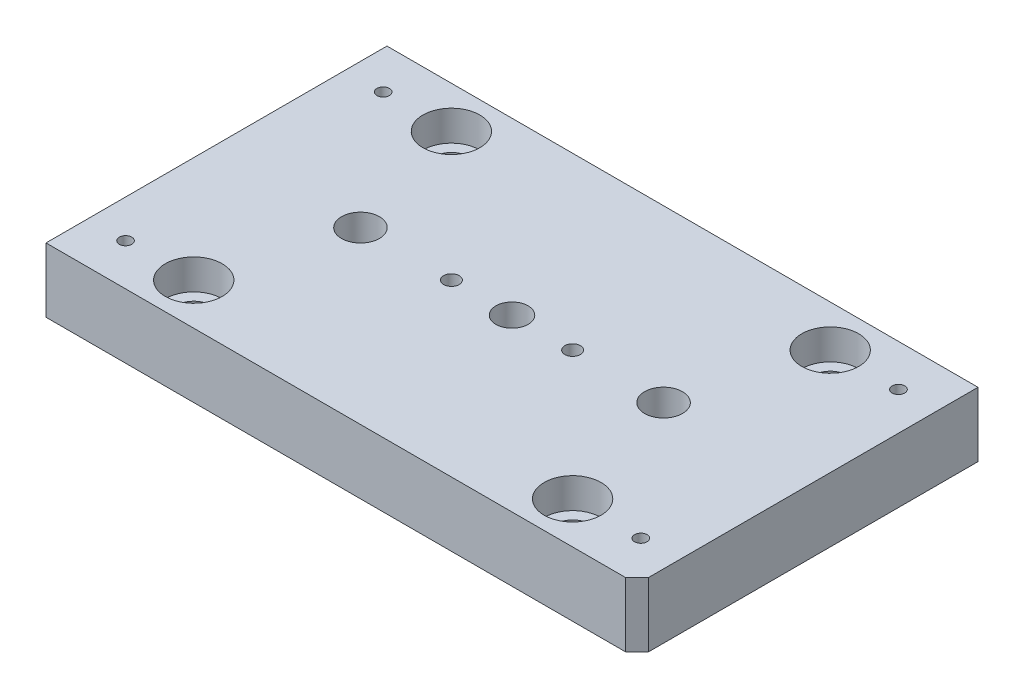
ISO-10303-21;
HEADER;
FILE_DESCRIPTION(('STEP AP214'),'2;1');
FILE_NAME('part.step','',(''),(''),'','','');
FILE_SCHEMA(('AUTOMOTIVE_DESIGN { 1 0 10303 214 1 1 1 1 }'));
ENDSEC;
DATA;
#1=APPLICATION_CONTEXT('core data for automotive mechanical design processes');
#2=APPLICATION_PROTOCOL_DEFINITION('international standard','automotive_design',2000,#1);
#3=PRODUCT_CONTEXT('',#1,'mechanical');
#4=PRODUCT('Part','Part','',(#3));
#5=PRODUCT_RELATED_PRODUCT_CATEGORY('part','',(#4));
#6=PRODUCT_DEFINITION_FORMATION('','',#4);
#7=PRODUCT_DEFINITION_CONTEXT('part definition',#1,'design');
#8=PRODUCT_DEFINITION('design','',#6,#7);
#9=PRODUCT_DEFINITION_SHAPE('','',#8);
#10=(LENGTH_UNIT() NAMED_UNIT(*) SI_UNIT(.MILLI.,.METRE.));
#11=(NAMED_UNIT(*) PLANE_ANGLE_UNIT() SI_UNIT($,.RADIAN.));
#12=(NAMED_UNIT(*) SI_UNIT($,.STERADIAN.) SOLID_ANGLE_UNIT());
#13=UNCERTAINTY_MEASURE_WITH_UNIT(LENGTH_MEASURE(1.E-05),#10,'distance_accuracy_value','');
#14=(GEOMETRIC_REPRESENTATION_CONTEXT(3) GLOBAL_UNCERTAINTY_ASSIGNED_CONTEXT((#13)) GLOBAL_UNIT_ASSIGNED_CONTEXT((#10,
#11,#12)) REPRESENTATION_CONTEXT('',''));
#15=CARTESIAN_POINT('',(0.,0.,0.));
#16=DIRECTION('',(0.,0.,1.));
#17=DIRECTION('',(1.,0.,0.));
#18=AXIS2_PLACEMENT_3D('',#15,#16,#17);
#19=CARTESIAN_POINT('',(0.,17.,0.));
#20=DIRECTION('',(0.,1.,0.));
#21=DIRECTION('',(0.,0.,1.));
#22=AXIS2_PLACEMENT_3D('',#19,#20,#21);
#23=CYLINDRICAL_SURFACE('',#22,4.24999999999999);
#24=CARTESIAN_POINT('',(0.,17.,0.));
#25=DIRECTION('',(0.,1.,0.));
#26=DIRECTION('',(0.,0.,1.));
#27=AXIS2_PLACEMENT_3D('',#24,#25,#26);
#28=CIRCLE('',#27,4.24999999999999);
#29=CARTESIAN_POINT('',(0.,17.,4.24999999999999));
#30=VERTEX_POINT('',#29);
#31=EDGE_CURVE('E165',#30,#30,#28,.T.);
#32=ORIENTED_EDGE('',*,*,#31,.T.);
#33=EDGE_LOOP('',(#32));
#34=FACE_BOUND('',#33,.T.);
#35=CARTESIAN_POINT('',(0.,4.,0.));
#36=DIRECTION('',(0.,-1.,0.));
#37=DIRECTION('',(0.,0.,-1.));
#38=AXIS2_PLACEMENT_3D('',#35,#36,#37);
#39=CIRCLE('',#38,4.24999999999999);
#40=CARTESIAN_POINT('',(0.,4.,-4.24999999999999));
#41=VERTEX_POINT('',#40);
#42=EDGE_CURVE('E172',#41,#41,#39,.F.);
#43=ORIENTED_EDGE('',*,*,#42,.F.);
#44=EDGE_LOOP('',(#43));
#45=FACE_BOUND('',#44,.T.);
#46=ADVANCED_FACE('F41',(#34,#45),#23,.F.);
#47=CARTESIAN_POINT('',(-16.,0.,0.));
#48=DIRECTION('',(0.,1.,0.));
#49=DIRECTION('',(0.,0.,1.));
#50=AXIS2_PLACEMENT_3D('',#47,#48,#49);
#51=CYLINDRICAL_SURFACE('',#50,2.05);
#52=CARTESIAN_POINT('',(-16.,17.,0.));
#53=DIRECTION('',(0.,1.,0.));
#54=DIRECTION('',(0.,0.,1.));
#55=AXIS2_PLACEMENT_3D('',#52,#53,#54);
#56=CIRCLE('',#55,2.05);
#57=CARTESIAN_POINT('',(-16.,17.,2.05));
#58=VERTEX_POINT('',#57);
#59=EDGE_CURVE('E545',#58,#58,#56,.T.);
#60=ORIENTED_EDGE('',*,*,#59,.T.);
#61=EDGE_LOOP('',(#60));
#62=FACE_BOUND('',#61,.T.);
#63=CARTESIAN_POINT('',(-16.,8.,0.));
#64=DIRECTION('',(0.,-1.,0.));
#65=DIRECTION('',(0.,0.,-1.));
#66=AXIS2_PLACEMENT_3D('',#63,#64,#65);
#67=CIRCLE('',#66,2.05);
#68=CARTESIAN_POINT('',(-16.,8.,-2.05));
#69=VERTEX_POINT('',#68);
#70=EDGE_CURVE('E167',#69,#69,#67,.F.);
#71=ORIENTED_EDGE('',*,*,#70,.F.);
#72=EDGE_LOOP('',(#71));
#73=FACE_BOUND('',#72,.T.);
#74=ADVANCED_FACE('F213',(#62,#73),#51,.F.);
#75=CARTESIAN_POINT('',(16.,0.,0.));
#76=DIRECTION('',(0.,1.,0.));
#77=DIRECTION('',(0.,0.,1.));
#78=AXIS2_PLACEMENT_3D('',#75,#76,#77);
#79=CYLINDRICAL_SURFACE('',#78,2.05);
#80=CARTESIAN_POINT('',(16.,17.,0.));
#81=DIRECTION('',(0.,1.,0.));
#82=DIRECTION('',(0.,0.,1.));
#83=AXIS2_PLACEMENT_3D('',#80,#81,#82);
#84=CIRCLE('',#83,2.05);
#85=CARTESIAN_POINT('',(16.,17.,2.05));
#86=VERTEX_POINT('',#85);
#87=EDGE_CURVE('E548',#86,#86,#84,.T.);
#88=ORIENTED_EDGE('',*,*,#87,.T.);
#89=EDGE_LOOP('',(#88));
#90=FACE_BOUND('',#89,.T.);
#91=CARTESIAN_POINT('',(16.,8.,0.));
#92=DIRECTION('',(0.,-1.,0.));
#93=DIRECTION('',(0.,0.,-1.));
#94=AXIS2_PLACEMENT_3D('',#91,#92,#93);
#95=CIRCLE('',#94,2.05);
#96=CARTESIAN_POINT('',(16.,8.,-2.05));
#97=VERTEX_POINT('',#96);
#98=EDGE_CURVE('E162',#97,#97,#95,.F.);
#99=ORIENTED_EDGE('',*,*,#98,.F.);
#100=EDGE_LOOP('',(#99));
#101=FACE_BOUND('',#100,.T.);
#102=ADVANCED_FACE('F219',(#90,#101),#79,.F.);
#103=CARTESIAN_POINT('',(-78.,17.,-45.));
#104=DIRECTION('',(1.,0.,0.));
#105=DIRECTION('',(0.,0.,-1.));
#106=AXIS2_PLACEMENT_3D('',#103,#104,#105);
#107=PLANE('',#106);
#108=DIRECTION('',(0.,0.,1.));
#109=VECTOR('',#108,1.);
#110=CARTESIAN_POINT('',(-78.,0.,-45.));
#111=LINE('',#110,#109);
#112=CARTESIAN_POINT('',(-78.,0.,-45.));
#113=VERTEX_POINT('',#112);
#114=CARTESIAN_POINT('',(-78.,0.,45.));
#115=VERTEX_POINT('',#114);
#116=EDGE_CURVE('E134',#113,#115,#111,.T.);
#117=ORIENTED_EDGE('',*,*,#116,.T.);
#118=DIRECTION('',(0.,-1.,0.));
#119=VECTOR('',#118,1.);
#120=CARTESIAN_POINT('',(-78.,17.,45.));
#121=LINE('',#120,#119);
#122=CARTESIAN_POINT('',(-78.,17.,45.));
#123=VERTEX_POINT('',#122);
#124=EDGE_CURVE('E158',#123,#115,#121,.T.);
#125=ORIENTED_EDGE('',*,*,#124,.F.);
#126=DIRECTION('',(0.,0.,1.));
#127=VECTOR('',#126,1.);
#128=CARTESIAN_POINT('',(-78.,17.,-45.));
#129=LINE('',#128,#127);
#130=CARTESIAN_POINT('',(-78.,17.,-45.));
#131=VERTEX_POINT('',#130);
#132=EDGE_CURVE('E143',#131,#123,#129,.T.);
#133=ORIENTED_EDGE('',*,*,#132,.F.);
#134=DIRECTION('',(0.,-1.,0.));
#135=VECTOR('',#134,1.);
#136=CARTESIAN_POINT('',(-78.,17.,-45.));
#137=LINE('',#136,#135);
#138=EDGE_CURVE('E152',#131,#113,#137,.T.);
#139=ORIENTED_EDGE('',*,*,#138,.T.);
#140=EDGE_LOOP('',(#117,#125,#133,#139));
#141=FACE_BOUND('',#140,.T.);
#142=ADVANCED_FACE('F195',(#141),#107,.F.);
#143=CARTESIAN_POINT('',(-78.,17.,45.));
#144=DIRECTION('',(0.,0.,-1.));
#145=DIRECTION('',(-1.,0.,0.));
#146=AXIS2_PLACEMENT_3D('',#143,#144,#145);
#147=PLANE('',#146);
#148=DIRECTION('',(1.,0.,0.));
#149=VECTOR('',#148,1.);
#150=CARTESIAN_POINT('',(-78.,0.,45.));
#151=LINE('',#150,#149);
#152=CARTESIAN_POINT('',(75.,0.,45.));
#153=VERTEX_POINT('',#152);
#154=EDGE_CURVE('E137',#115,#153,#151,.T.);
#155=ORIENTED_EDGE('',*,*,#154,.T.);
#156=DIRECTION('',(0.,1.,0.));
#157=VECTOR('',#156,1.);
#158=CARTESIAN_POINT('',(75.,17.,45.));
#159=LINE('',#158,#157);
#160=CARTESIAN_POINT('',(75.,17.,45.));
#161=VERTEX_POINT('',#160);
#162=EDGE_CURVE('E49',#153,#161,#159,.T.);
#163=ORIENTED_EDGE('',*,*,#162,.T.);
#164=DIRECTION('',(1.,0.,0.));
#165=VECTOR('',#164,1.);
#166=CARTESIAN_POINT('',(-78.,17.,45.));
#167=LINE('',#166,#165);
#168=EDGE_CURVE('E146',#123,#161,#167,.T.);
#169=ORIENTED_EDGE('',*,*,#168,.F.);
#170=ORIENTED_EDGE('',*,*,#124,.T.);
#171=EDGE_LOOP('',(#155,#163,#169,#170));
#172=FACE_BOUND('',#171,.T.);
#173=ADVANCED_FACE('F315',(#172),#147,.F.);
#174=CARTESIAN_POINT('',(78.,17.,-45.));
#175=DIRECTION('',(-1.,0.,0.));
#176=DIRECTION('',(0.,0.,1.));
#177=AXIS2_PLACEMENT_3D('',#174,#175,#176);
#178=PLANE('',#177);
#179=DIRECTION('',(0.,0.,-1.));
#180=VECTOR('',#179,1.);
#181=CARTESIAN_POINT('',(78.,17.,-45.));
#182=LINE('',#181,#180);
#183=CARTESIAN_POINT('',(78.,17.,42.));
#184=VERTEX_POINT('',#183);
#185=CARTESIAN_POINT('',(78.,17.,-45.));
#186=VERTEX_POINT('',#185);
#187=EDGE_CURVE('E148',#184,#186,#182,.T.);
#188=ORIENTED_EDGE('',*,*,#187,.F.);
#189=DIRECTION('',(0.,-1.,0.));
#190=VECTOR('',#189,1.);
#191=CARTESIAN_POINT('',(78.,17.,42.));
#192=LINE('',#191,#190);
#193=CARTESIAN_POINT('',(78.,0.,42.));
#194=VERTEX_POINT('',#193);
#195=EDGE_CURVE('E161',#184,#194,#192,.T.);
#196=ORIENTED_EDGE('',*,*,#195,.T.);
#197=DIRECTION('',(0.,0.,-1.));
#198=VECTOR('',#197,1.);
#199=CARTESIAN_POINT('',(78.,0.,-45.));
#200=LINE('',#199,#198);
#201=CARTESIAN_POINT('',(78.,0.,-45.));
#202=VERTEX_POINT('',#201);
#203=EDGE_CURVE('E139',#194,#202,#200,.T.);
#204=ORIENTED_EDGE('',*,*,#203,.T.);
#205=DIRECTION('',(0.,-1.,0.));
#206=VECTOR('',#205,1.);
#207=CARTESIAN_POINT('',(78.,17.,-45.));
#208=LINE('',#207,#206);
#209=EDGE_CURVE('E155',#186,#202,#208,.T.);
#210=ORIENTED_EDGE('',*,*,#209,.F.);
#211=EDGE_LOOP('',(#188,#196,#204,#210));
#212=FACE_BOUND('',#211,.T.);
#213=ADVANCED_FACE('F182',(#212),#178,.F.);
#214=CARTESIAN_POINT('',(-78.,17.,-45.));
#215=DIRECTION('',(0.,0.,1.));
#216=DIRECTION('',(1.,0.,0.));
#217=AXIS2_PLACEMENT_3D('',#214,#215,#216);
#218=PLANE('',#217);
#219=DIRECTION('',(-1.,0.,0.));
#220=VECTOR('',#219,1.);
#221=CARTESIAN_POINT('',(-78.,0.,-45.));
#222=LINE('',#221,#220);
#223=EDGE_CURVE('E141',#202,#113,#222,.T.);
#224=ORIENTED_EDGE('',*,*,#223,.T.);
#225=ORIENTED_EDGE('',*,*,#138,.F.);
#226=DIRECTION('',(-1.,0.,0.));
#227=VECTOR('',#226,1.);
#228=CARTESIAN_POINT('',(-78.,17.,-45.));
#229=LINE('',#228,#227);
#230=EDGE_CURVE('E150',#186,#131,#229,.T.);
#231=ORIENTED_EDGE('',*,*,#230,.F.);
#232=ORIENTED_EDGE('',*,*,#209,.T.);
#233=EDGE_LOOP('',(#224,#225,#231,#232));
#234=FACE_BOUND('',#233,.T.);
#235=ADVANCED_FACE('F191',(#234),#218,.F.);
#236=CARTESIAN_POINT('',(-78.,17.,45.));
#237=DIRECTION('',(0.,1.,0.));
#238=DIRECTION('',(0.,0.,1.));
#239=AXIS2_PLACEMENT_3D('',#236,#237,#238);
#240=PLANE('',#239);
#241=CARTESIAN_POINT('',(-40.,17.,0.));
#242=DIRECTION('',(0.,-1.,0.));
#243=DIRECTION('',(0.,0.,-1.));
#244=AXIS2_PLACEMENT_3D('',#241,#242,#243);
#245=CIRCLE('',#244,5.);
#246=CARTESIAN_POINT('',(-40.,17.,-5.));
#247=VERTEX_POINT('',#246);
#248=EDGE_CURVE('E518',#247,#247,#245,.T.);
#249=ORIENTED_EDGE('',*,*,#248,.T.);
#250=EDGE_LOOP('',(#249));
#251=FACE_BOUND('',#250,.T.);
#252=CARTESIAN_POINT('',(40.,17.,0.));
#253=DIRECTION('',(0.,-1.,0.));
#254=DIRECTION('',(0.,0.,-1.));
#255=AXIS2_PLACEMENT_3D('',#252,#253,#254);
#256=CIRCLE('',#255,5.);
#257=CARTESIAN_POINT('',(40.,17.,-5.));
#258=VERTEX_POINT('',#257);
#259=EDGE_CURVE('E526',#258,#258,#256,.T.);
#260=ORIENTED_EDGE('',*,*,#259,.T.);
#261=EDGE_LOOP('',(#260));
#262=FACE_BOUND('',#261,.T.);
#263=ORIENTED_EDGE('',*,*,#31,.F.);
#264=EDGE_LOOP('',(#263));
#265=FACE_BOUND('',#264,.T.);
#266=ORIENTED_EDGE('',*,*,#59,.F.);
#267=EDGE_LOOP('',(#266));
#268=FACE_BOUND('',#267,.T.);
#269=ORIENTED_EDGE('',*,*,#87,.F.);
#270=EDGE_LOOP('',(#269));
#271=FACE_BOUND('',#270,.T.);
#272=CARTESIAN_POINT('',(50.,17.,34.));
#273=DIRECTION('',(0.,1.,0.));
#274=DIRECTION('',(0.,0.,1.));
#275=AXIS2_PLACEMENT_3D('',#272,#273,#274);
#276=CIRCLE('',#275,7.5);
#277=CARTESIAN_POINT('',(50.,17.,41.5));
#278=VERTEX_POINT('',#277);
#279=EDGE_CURVE('E551',#278,#278,#276,.T.);
#280=ORIENTED_EDGE('',*,*,#279,.F.);
#281=EDGE_LOOP('',(#280));
#282=FACE_BOUND('',#281,.T.);
#283=CARTESIAN_POINT('',(50.,17.,-34.));
#284=DIRECTION('',(0.,1.,0.));
#285=DIRECTION('',(0.,0.,1.));
#286=AXIS2_PLACEMENT_3D('',#283,#284,#285);
#287=CIRCLE('',#286,7.5);
#288=CARTESIAN_POINT('',(50.,17.,-26.5));
#289=VERTEX_POINT('',#288);
#290=EDGE_CURVE('E563',#289,#289,#287,.T.);
#291=ORIENTED_EDGE('',*,*,#290,.F.);
#292=EDGE_LOOP('',(#291));
#293=FACE_BOUND('',#292,.T.);
#294=CARTESIAN_POINT('',(-50.,17.,-34.));
#295=DIRECTION('',(0.,1.,0.));
#296=DIRECTION('',(0.,0.,1.));
#297=AXIS2_PLACEMENT_3D('',#294,#295,#296);
#298=CIRCLE('',#297,7.5);
#299=CARTESIAN_POINT('',(-50.,17.,-26.5));
#300=VERTEX_POINT('',#299);
#301=EDGE_CURVE('E575',#300,#300,#298,.T.);
#302=ORIENTED_EDGE('',*,*,#301,.F.);
#303=EDGE_LOOP('',(#302));
#304=FACE_BOUND('',#303,.T.);
#305=CARTESIAN_POINT('',(-50.,17.,34.));
#306=DIRECTION('',(0.,1.,0.));
#307=DIRECTION('',(0.,0.,1.));
#308=AXIS2_PLACEMENT_3D('',#305,#306,#307);
#309=CIRCLE('',#308,7.5);
#310=CARTESIAN_POINT('',(-50.,17.,41.5));
#311=VERTEX_POINT('',#310);
#312=EDGE_CURVE('E587',#311,#311,#309,.T.);
#313=ORIENTED_EDGE('',*,*,#312,.F.);
#314=EDGE_LOOP('',(#313));
#315=FACE_BOUND('',#314,.T.);
#316=CARTESIAN_POINT('',(68.,17.,34.));
#317=DIRECTION('',(0.,1.,0.));
#318=DIRECTION('',(0.,0.,1.));
#319=AXIS2_PLACEMENT_3D('',#316,#317,#318);
#320=CIRCLE('',#319,1.65);
#321=CARTESIAN_POINT('',(68.,17.,35.65));
#322=VERTEX_POINT('',#321);
#323=EDGE_CURVE('E106',#322,#322,#320,.T.);
#324=ORIENTED_EDGE('',*,*,#323,.F.);
#325=EDGE_LOOP('',(#324));
#326=FACE_BOUND('',#325,.T.);
#327=CARTESIAN_POINT('',(68.,17.,-34.));
#328=DIRECTION('',(0.,1.,0.));
#329=DIRECTION('',(0.,0.,1.));
#330=AXIS2_PLACEMENT_3D('',#327,#328,#329);
#331=CIRCLE('',#330,1.65);
#332=CARTESIAN_POINT('',(68.,17.,-32.35));
#333=VERTEX_POINT('',#332);
#334=EDGE_CURVE('E119',#333,#333,#331,.T.);
#335=ORIENTED_EDGE('',*,*,#334,.F.);
#336=EDGE_LOOP('',(#335));
#337=FACE_BOUND('',#336,.T.);
#338=CARTESIAN_POINT('',(-68.,17.,-34.));
#339=DIRECTION('',(0.,1.,0.));
#340=DIRECTION('',(0.,0.,1.));
#341=AXIS2_PLACEMENT_3D('',#338,#339,#340);
#342=CIRCLE('',#341,1.65);
#343=CARTESIAN_POINT('',(-68.,17.,-32.35));
#344=VERTEX_POINT('',#343);
#345=EDGE_CURVE('E125',#344,#344,#342,.T.);
#346=ORIENTED_EDGE('',*,*,#345,.F.);
#347=EDGE_LOOP('',(#346));
#348=FACE_BOUND('',#347,.T.);
#349=CARTESIAN_POINT('',(-68.,17.,34.));
#350=DIRECTION('',(0.,1.,0.));
#351=DIRECTION('',(0.,0.,1.));
#352=AXIS2_PLACEMENT_3D('',#349,#350,#351);
#353=CIRCLE('',#352,1.65);
#354=CARTESIAN_POINT('',(-68.,17.,35.65));
#355=VERTEX_POINT('',#354);
#356=EDGE_CURVE('E131',#355,#355,#353,.T.);
#357=ORIENTED_EDGE('',*,*,#356,.F.);
#358=EDGE_LOOP('',(#357));
#359=FACE_BOUND('',#358,.T.);
#360=ORIENTED_EDGE('',*,*,#168,.T.);
#361=DIRECTION('',(-0.707106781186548,0.,0.707106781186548));
#362=VECTOR('',#361,1.);
#363=CARTESIAN_POINT('',(-1.5,17.,121.5));
#364=LINE('',#363,#362);
#365=EDGE_CURVE('E11',#161,#184,#364,.F.);
#366=ORIENTED_EDGE('',*,*,#365,.T.);
#367=ORIENTED_EDGE('',*,*,#187,.T.);
#368=ORIENTED_EDGE('',*,*,#230,.T.);
#369=ORIENTED_EDGE('',*,*,#132,.T.);
#370=EDGE_LOOP('',(#360,#366,#367,#368,#369));
#371=FACE_BOUND('',#370,.T.);
#372=ADVANCED_FACE('F198',(#251,#262,#265,#268,#271,#282,#293,#304,#315,#326,#337,#348,#359,
#371),#240,.T.);
#373=CARTESIAN_POINT('',(-78.,0.,45.));
#374=DIRECTION('',(0.,1.,0.));
#375=DIRECTION('',(0.,0.,1.));
#376=AXIS2_PLACEMENT_3D('',#373,#374,#375);
#377=PLANE('',#376);
#378=CARTESIAN_POINT('',(-40.,0.,0.));
#379=DIRECTION('',(0.,-1.,0.));
#380=DIRECTION('',(0.,0.,-1.));
#381=AXIS2_PLACEMENT_3D('',#378,#379,#380);
#382=CIRCLE('',#381,5.);
#383=CARTESIAN_POINT('',(-40.,0.,-5.));
#384=VERTEX_POINT('',#383);
#385=EDGE_CURVE('E521',#384,#384,#382,.T.);
#386=ORIENTED_EDGE('',*,*,#385,.F.);
#387=EDGE_LOOP('',(#386));
#388=FACE_BOUND('',#387,.T.);
#389=CARTESIAN_POINT('',(40.,0.,0.));
#390=DIRECTION('',(0.,-1.,0.));
#391=DIRECTION('',(0.,0.,-1.));
#392=AXIS2_PLACEMENT_3D('',#389,#390,#391);
#393=CIRCLE('',#392,5.);
#394=CARTESIAN_POINT('',(40.,0.,-5.));
#395=VERTEX_POINT('',#394);
#396=EDGE_CURVE('E523',#395,#395,#393,.T.);
#397=ORIENTED_EDGE('',*,*,#396,.F.);
#398=EDGE_LOOP('',(#397));
#399=FACE_BOUND('',#398,.T.);
#400=CARTESIAN_POINT('',(0.,0.,0.));
#401=DIRECTION('',(0.,-1.,0.));
#402=DIRECTION('',(0.,0.,-1.));
#403=AXIS2_PLACEMENT_3D('',#400,#401,#402);
#404=CIRCLE('',#403,6.75);
#405=CARTESIAN_POINT('',(0.,0.,-6.75));
#406=VERTEX_POINT('',#405);
#407=EDGE_CURVE('E529',#406,#406,#404,.T.);
#408=ORIENTED_EDGE('',*,*,#407,.F.);
#409=EDGE_LOOP('',(#408));
#410=FACE_BOUND('',#409,.T.);
#411=CARTESIAN_POINT('',(-16.,0.,0.));
#412=DIRECTION('',(0.,-1.,0.));
#413=DIRECTION('',(0.,0.,-1.));
#414=AXIS2_PLACEMENT_3D('',#411,#412,#413);
#415=CIRCLE('',#414,4.5);
#416=CARTESIAN_POINT('',(-16.,0.,-4.5));
#417=VERTEX_POINT('',#416);
#418=EDGE_CURVE('E175',#417,#417,#415,.T.);
#419=ORIENTED_EDGE('',*,*,#418,.F.);
#420=EDGE_LOOP('',(#419));
#421=FACE_BOUND('',#420,.T.);
#422=CARTESIAN_POINT('',(16.,0.,0.));
#423=DIRECTION('',(0.,-1.,0.));
#424=DIRECTION('',(0.,0.,-1.));
#425=AXIS2_PLACEMENT_3D('',#422,#423,#424);
#426=CIRCLE('',#425,4.5);
#427=CARTESIAN_POINT('',(16.,0.,-4.5));
#428=VERTEX_POINT('',#427);
#429=EDGE_CURVE('E170',#428,#428,#426,.T.);
#430=ORIENTED_EDGE('',*,*,#429,.F.);
#431=EDGE_LOOP('',(#430));
#432=FACE_BOUND('',#431,.T.);
#433=CARTESIAN_POINT('',(50.,0.,34.));
#434=DIRECTION('',(0.,1.,0.));
#435=DIRECTION('',(0.,0.,1.));
#436=AXIS2_PLACEMENT_3D('',#433,#434,#435);
#437=CIRCLE('',#436,4.5);
#438=CARTESIAN_POINT('',(50.,0.,38.5));
#439=VERTEX_POINT('',#438);
#440=EDGE_CURVE('E560',#439,#439,#437,.T.);
#441=ORIENTED_EDGE('',*,*,#440,.T.);
#442=EDGE_LOOP('',(#441));
#443=FACE_BOUND('',#442,.T.);
#444=CARTESIAN_POINT('',(50.,0.,-34.));
#445=DIRECTION('',(0.,1.,0.));
#446=DIRECTION('',(0.,0.,1.));
#447=AXIS2_PLACEMENT_3D('',#444,#445,#446);
#448=CIRCLE('',#447,4.5);
#449=CARTESIAN_POINT('',(50.,0.,-29.5));
#450=VERTEX_POINT('',#449);
#451=EDGE_CURVE('E572',#450,#450,#448,.T.);
#452=ORIENTED_EDGE('',*,*,#451,.T.);
#453=EDGE_LOOP('',(#452));
#454=FACE_BOUND('',#453,.T.);
#455=CARTESIAN_POINT('',(-50.,0.,-34.));
#456=DIRECTION('',(0.,1.,0.));
#457=DIRECTION('',(0.,0.,1.));
#458=AXIS2_PLACEMENT_3D('',#455,#456,#457);
#459=CIRCLE('',#458,4.5);
#460=CARTESIAN_POINT('',(-50.,0.,-29.5));
#461=VERTEX_POINT('',#460);
#462=EDGE_CURVE('E584',#461,#461,#459,.T.);
#463=ORIENTED_EDGE('',*,*,#462,.T.);
#464=EDGE_LOOP('',(#463));
#465=FACE_BOUND('',#464,.T.);
#466=CARTESIAN_POINT('',(-50.,0.,34.));
#467=DIRECTION('',(0.,1.,0.));
#468=DIRECTION('',(0.,0.,1.));
#469=AXIS2_PLACEMENT_3D('',#466,#467,#468);
#470=CIRCLE('',#469,4.5);
#471=CARTESIAN_POINT('',(-50.,0.,38.5));
#472=VERTEX_POINT('',#471);
#473=EDGE_CURVE('E107',#472,#472,#470,.T.);
#474=ORIENTED_EDGE('',*,*,#473,.T.);
#475=EDGE_LOOP('',(#474));
#476=FACE_BOUND('',#475,.T.);
#477=ORIENTED_EDGE('',*,*,#203,.F.);
#478=DIRECTION('',(0.707106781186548,0.,-0.707106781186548));
#479=VECTOR('',#478,1.);
#480=CARTESIAN_POINT('',(78.,0.,42.));
#481=LINE('',#480,#479);
#482=EDGE_CURVE('E63',#194,#153,#481,.F.);
#483=ORIENTED_EDGE('',*,*,#482,.T.);
#484=ORIENTED_EDGE('',*,*,#154,.F.);
#485=ORIENTED_EDGE('',*,*,#116,.F.);
#486=ORIENTED_EDGE('',*,*,#223,.F.);
#487=EDGE_LOOP('',(#477,#483,#484,#485,#486));
#488=FACE_BOUND('',#487,.T.);
#489=ADVANCED_FACE('F187',(#388,#399,#410,#421,#432,#443,#454,#465,#476,#488),#377,.F.);
#490=CARTESIAN_POINT('',(-68.,17.,34.));
#491=DIRECTION('',(0.,1.,0.));
#492=DIRECTION('',(0.,0.,1.));
#493=AXIS2_PLACEMENT_3D('',#490,#491,#492);
#494=CYLINDRICAL_SURFACE('',#493,1.65);
#495=CARTESIAN_POINT('',(-68.,6.9,34.));
#496=DIRECTION('',(0.,1.,0.));
#497=DIRECTION('',(0.,0.,1.));
#498=AXIS2_PLACEMENT_3D('',#495,#496,#497);
#499=CIRCLE('',#498,1.65);
#500=CARTESIAN_POINT('',(-68.,6.9,35.65));
#501=VERTEX_POINT('',#500);
#502=EDGE_CURVE('E128',#501,#501,#499,.T.);
#503=ORIENTED_EDGE('',*,*,#502,.F.);
#504=EDGE_LOOP('',(#503));
#505=FACE_BOUND('',#504,.T.);
#506=ORIENTED_EDGE('',*,*,#356,.T.);
#507=EDGE_LOOP('',(#506));
#508=FACE_BOUND('',#507,.T.);
#509=ADVANCED_FACE('F300',(#505,#508),#494,.F.);
#510=CARTESIAN_POINT('',(-68.,6.9,34.));
#511=DIRECTION('',(0.,1.,0.));
#512=DIRECTION('',(0.,0.,1.));
#513=AXIS2_PLACEMENT_3D('',#510,#511,#512);
#514=CONICAL_SURFACE('',#513,1.65,1.02974425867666);
#515=CARTESIAN_POINT('',(-68.,5.90857997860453,34.));
#516=VERTEX_POINT('',#515);
#517=VERTEX_LOOP('',#516);
#518=FACE_BOUND('',#517,.T.);
#519=ORIENTED_EDGE('',*,*,#502,.T.);
#520=EDGE_LOOP('',(#519));
#521=FACE_BOUND('',#520,.T.);
#522=ADVANCED_FACE('F296',(#518,#521),#514,.F.);
#523=CARTESIAN_POINT('',(-68.,17.,-34.));
#524=DIRECTION('',(0.,1.,0.));
#525=DIRECTION('',(0.,0.,1.));
#526=AXIS2_PLACEMENT_3D('',#523,#524,#525);
#527=CYLINDRICAL_SURFACE('',#526,1.65);
#528=CARTESIAN_POINT('',(-68.,6.9,-34.));
#529=DIRECTION('',(0.,1.,0.));
#530=DIRECTION('',(0.,0.,1.));
#531=AXIS2_PLACEMENT_3D('',#528,#529,#530);
#532=CIRCLE('',#531,1.65);
#533=CARTESIAN_POINT('',(-68.,6.9,-32.35));
#534=VERTEX_POINT('',#533);
#535=EDGE_CURVE('E122',#534,#534,#532,.T.);
#536=ORIENTED_EDGE('',*,*,#535,.F.);
#537=EDGE_LOOP('',(#536));
#538=FACE_BOUND('',#537,.T.);
#539=ORIENTED_EDGE('',*,*,#345,.T.);
#540=EDGE_LOOP('',(#539));
#541=FACE_BOUND('',#540,.T.);
#542=ADVANCED_FACE('F292',(#538,#541),#527,.F.);
#543=CARTESIAN_POINT('',(-68.,6.9,-34.));
#544=DIRECTION('',(0.,1.,0.));
#545=DIRECTION('',(0.,0.,1.));
#546=AXIS2_PLACEMENT_3D('',#543,#544,#545);
#547=CONICAL_SURFACE('',#546,1.65,1.02974425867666);
#548=CARTESIAN_POINT('',(-68.,5.90857997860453,-34.));
#549=VERTEX_POINT('',#548);
#550=VERTEX_LOOP('',#549);
#551=FACE_BOUND('',#550,.T.);
#552=ORIENTED_EDGE('',*,*,#535,.T.);
#553=EDGE_LOOP('',(#552));
#554=FACE_BOUND('',#553,.T.);
#555=ADVANCED_FACE('F288',(#551,#554),#547,.F.);
#556=CARTESIAN_POINT('',(68.,17.,-34.));
#557=DIRECTION('',(0.,1.,0.));
#558=DIRECTION('',(0.,0.,1.));
#559=AXIS2_PLACEMENT_3D('',#556,#557,#558);
#560=CYLINDRICAL_SURFACE('',#559,1.65);
#561=CARTESIAN_POINT('',(68.,6.9,-34.));
#562=DIRECTION('',(0.,1.,0.));
#563=DIRECTION('',(0.,0.,1.));
#564=AXIS2_PLACEMENT_3D('',#561,#562,#563);
#565=CIRCLE('',#564,1.65);
#566=CARTESIAN_POINT('',(68.,6.9,-32.35));
#567=VERTEX_POINT('',#566);
#568=EDGE_CURVE('E110',#567,#567,#565,.T.);
#569=ORIENTED_EDGE('',*,*,#568,.F.);
#570=EDGE_LOOP('',(#569));
#571=FACE_BOUND('',#570,.T.);
#572=ORIENTED_EDGE('',*,*,#334,.T.);
#573=EDGE_LOOP('',(#572));
#574=FACE_BOUND('',#573,.T.);
#575=ADVANCED_FACE('F284',(#571,#574),#560,.F.);
#576=CARTESIAN_POINT('',(68.,6.9,-34.));
#577=DIRECTION('',(0.,1.,0.));
#578=DIRECTION('',(0.,0.,1.));
#579=AXIS2_PLACEMENT_3D('',#576,#577,#578);
#580=CONICAL_SURFACE('',#579,1.65,1.02974425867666);
#581=CARTESIAN_POINT('',(68.,5.90857997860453,-34.));
#582=VERTEX_POINT('',#581);
#583=VERTEX_LOOP('',#582);
#584=FACE_BOUND('',#583,.T.);
#585=ORIENTED_EDGE('',*,*,#568,.T.);
#586=EDGE_LOOP('',(#585));
#587=FACE_BOUND('',#586,.T.);
#588=ADVANCED_FACE('F281',(#584,#587),#580,.F.);
#589=CARTESIAN_POINT('',(68.,17.,34.));
#590=DIRECTION('',(0.,1.,0.));
#591=DIRECTION('',(0.,0.,1.));
#592=AXIS2_PLACEMENT_3D('',#589,#590,#591);
#593=CYLINDRICAL_SURFACE('',#592,1.65);
#594=CARTESIAN_POINT('',(68.,6.9,34.));
#595=DIRECTION('',(0.,1.,0.));
#596=DIRECTION('',(0.,0.,1.));
#597=AXIS2_PLACEMENT_3D('',#594,#595,#596);
#598=CIRCLE('',#597,1.65);
#599=CARTESIAN_POINT('',(68.,6.9,35.65));
#600=VERTEX_POINT('',#599);
#601=EDGE_CURVE('E104',#600,#600,#598,.T.);
#602=ORIENTED_EDGE('',*,*,#601,.F.);
#603=EDGE_LOOP('',(#602));
#604=FACE_BOUND('',#603,.T.);
#605=ORIENTED_EDGE('',*,*,#323,.T.);
#606=EDGE_LOOP('',(#605));
#607=FACE_BOUND('',#606,.T.);
#608=ADVANCED_FACE('F100',(#604,#607),#593,.F.);
#609=CARTESIAN_POINT('',(68.,6.9,34.));
#610=DIRECTION('',(0.,1.,0.));
#611=DIRECTION('',(0.,0.,1.));
#612=AXIS2_PLACEMENT_3D('',#609,#610,#611);
#613=CONICAL_SURFACE('',#612,1.65,1.02974425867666);
#614=CARTESIAN_POINT('',(68.,5.90857997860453,34.));
#615=VERTEX_POINT('',#614);
#616=VERTEX_LOOP('',#615);
#617=FACE_BOUND('',#616,.T.);
#618=ORIENTED_EDGE('',*,*,#601,.T.);
#619=EDGE_LOOP('',(#618));
#620=FACE_BOUND('',#619,.T.);
#621=ADVANCED_FACE('F96',(#617,#620),#613,.F.);
#622=CARTESIAN_POINT('',(-50.,17.,34.));
#623=DIRECTION('',(0.,1.,0.));
#624=DIRECTION('',(0.,0.,1.));
#625=AXIS2_PLACEMENT_3D('',#622,#623,#624);
#626=CYLINDRICAL_SURFACE('',#625,4.5);
#627=ORIENTED_EDGE('',*,*,#473,.F.);
#628=EDGE_LOOP('',(#627));
#629=FACE_BOUND('',#628,.T.);
#630=CARTESIAN_POINT('',(-50.,9.,34.));
#631=DIRECTION('',(0.,1.,0.));
#632=DIRECTION('',(0.,0.,1.));
#633=AXIS2_PLACEMENT_3D('',#630,#631,#632);
#634=CIRCLE('',#633,4.5);
#635=CARTESIAN_POINT('',(-50.,9.,38.5));
#636=VERTEX_POINT('',#635);
#637=EDGE_CURVE('E113',#636,#636,#634,.T.);
#638=ORIENTED_EDGE('',*,*,#637,.T.);
#639=EDGE_LOOP('',(#638));
#640=FACE_BOUND('',#639,.T.);
#641=ADVANCED_FACE('F99',(#629,#640),#626,.F.);
#642=CARTESIAN_POINT('',(-45.5,9.,34.));
#643=DIRECTION('',(0.,-1.,0.));
#644=DIRECTION('',(0.,0.,-1.));
#645=AXIS2_PLACEMENT_3D('',#642,#643,#644);
#646=PLANE('',#645);
#647=ORIENTED_EDGE('',*,*,#637,.F.);
#648=EDGE_LOOP('',(#647));
#649=FACE_BOUND('',#648,.T.);
#650=CARTESIAN_POINT('',(-50.,9.,34.));
#651=DIRECTION('',(0.,1.,0.));
#652=DIRECTION('',(0.,0.,1.));
#653=AXIS2_PLACEMENT_3D('',#650,#651,#652);
#654=CIRCLE('',#653,7.5);
#655=CARTESIAN_POINT('',(-50.,9.,41.5));
#656=VERTEX_POINT('',#655);
#657=EDGE_CURVE('E590',#656,#656,#654,.T.);
#658=ORIENTED_EDGE('',*,*,#657,.T.);
#659=EDGE_LOOP('',(#658));
#660=FACE_BOUND('',#659,.T.);
#661=ADVANCED_FACE('F271',(#649,#660),#646,.F.);
#662=CARTESIAN_POINT('',(-50.,17.,34.));
#663=DIRECTION('',(0.,1.,0.));
#664=DIRECTION('',(0.,0.,1.));
#665=AXIS2_PLACEMENT_3D('',#662,#663,#664);
#666=CYLINDRICAL_SURFACE('',#665,7.5);
#667=ORIENTED_EDGE('',*,*,#657,.F.);
#668=EDGE_LOOP('',(#667));
#669=FACE_BOUND('',#668,.T.);
#670=ORIENTED_EDGE('',*,*,#312,.T.);
#671=EDGE_LOOP('',(#670));
#672=FACE_BOUND('',#671,.T.);
#673=ADVANCED_FACE('F267',(#669,#672),#666,.F.);
#674=CARTESIAN_POINT('',(-50.,17.,-34.));
#675=DIRECTION('',(0.,1.,0.));
#676=DIRECTION('',(0.,0.,1.));
#677=AXIS2_PLACEMENT_3D('',#674,#675,#676);
#678=CYLINDRICAL_SURFACE('',#677,4.5);
#679=ORIENTED_EDGE('',*,*,#462,.F.);
#680=EDGE_LOOP('',(#679));
#681=FACE_BOUND('',#680,.T.);
#682=CARTESIAN_POINT('',(-50.,9.,-34.));
#683=DIRECTION('',(0.,1.,0.));
#684=DIRECTION('',(0.,0.,1.));
#685=AXIS2_PLACEMENT_3D('',#682,#683,#684);
#686=CIRCLE('',#685,4.5);
#687=CARTESIAN_POINT('',(-50.,9.,-29.5));
#688=VERTEX_POINT('',#687);
#689=EDGE_CURVE('E581',#688,#688,#686,.T.);
#690=ORIENTED_EDGE('',*,*,#689,.T.);
#691=EDGE_LOOP('',(#690));
#692=FACE_BOUND('',#691,.T.);
#693=ADVANCED_FACE('F263',(#681,#692),#678,.F.);
#694=CARTESIAN_POINT('',(-45.5,9.,-34.));
#695=DIRECTION('',(0.,-1.,0.));
#696=DIRECTION('',(0.,0.,-1.));
#697=AXIS2_PLACEMENT_3D('',#694,#695,#696);
#698=PLANE('',#697);
#699=ORIENTED_EDGE('',*,*,#689,.F.);
#700=EDGE_LOOP('',(#699));
#701=FACE_BOUND('',#700,.T.);
#702=CARTESIAN_POINT('',(-50.,9.,-34.));
#703=DIRECTION('',(0.,1.,0.));
#704=DIRECTION('',(0.,0.,1.));
#705=AXIS2_PLACEMENT_3D('',#702,#703,#704);
#706=CIRCLE('',#705,7.5);
#707=CARTESIAN_POINT('',(-50.,9.,-26.5));
#708=VERTEX_POINT('',#707);
#709=EDGE_CURVE('E578',#708,#708,#706,.T.);
#710=ORIENTED_EDGE('',*,*,#709,.T.);
#711=EDGE_LOOP('',(#710));
#712=FACE_BOUND('',#711,.T.);
#713=ADVANCED_FACE('F259',(#701,#712),#698,.F.);
#714=CARTESIAN_POINT('',(-50.,17.,-34.));
#715=DIRECTION('',(0.,1.,0.));
#716=DIRECTION('',(0.,0.,1.));
#717=AXIS2_PLACEMENT_3D('',#714,#715,#716);
#718=CYLINDRICAL_SURFACE('',#717,7.5);
#719=ORIENTED_EDGE('',*,*,#709,.F.);
#720=EDGE_LOOP('',(#719));
#721=FACE_BOUND('',#720,.T.);
#722=ORIENTED_EDGE('',*,*,#301,.T.);
#723=EDGE_LOOP('',(#722));
#724=FACE_BOUND('',#723,.T.);
#725=ADVANCED_FACE('F255',(#721,#724),#718,.F.);
#726=CARTESIAN_POINT('',(50.,17.,-34.));
#727=DIRECTION('',(0.,1.,0.));
#728=DIRECTION('',(0.,0.,1.));
#729=AXIS2_PLACEMENT_3D('',#726,#727,#728);
#730=CYLINDRICAL_SURFACE('',#729,4.5);
#731=ORIENTED_EDGE('',*,*,#451,.F.);
#732=EDGE_LOOP('',(#731));
#733=FACE_BOUND('',#732,.T.);
#734=CARTESIAN_POINT('',(50.,9.,-34.));
#735=DIRECTION('',(0.,1.,0.));
#736=DIRECTION('',(0.,0.,1.));
#737=AXIS2_PLACEMENT_3D('',#734,#735,#736);
#738=CIRCLE('',#737,4.5);
#739=CARTESIAN_POINT('',(50.,9.,-29.5));
#740=VERTEX_POINT('',#739);
#741=EDGE_CURVE('E569',#740,#740,#738,.T.);
#742=ORIENTED_EDGE('',*,*,#741,.T.);
#743=EDGE_LOOP('',(#742));
#744=FACE_BOUND('',#743,.T.);
#745=ADVANCED_FACE('F251',(#733,#744),#730,.F.);
#746=CARTESIAN_POINT('',(54.5,9.,-34.));
#747=DIRECTION('',(0.,-1.,0.));
#748=DIRECTION('',(0.,0.,-1.));
#749=AXIS2_PLACEMENT_3D('',#746,#747,#748);
#750=PLANE('',#749);
#751=ORIENTED_EDGE('',*,*,#741,.F.);
#752=EDGE_LOOP('',(#751));
#753=FACE_BOUND('',#752,.T.);
#754=CARTESIAN_POINT('',(50.,9.,-34.));
#755=DIRECTION('',(0.,1.,0.));
#756=DIRECTION('',(0.,0.,1.));
#757=AXIS2_PLACEMENT_3D('',#754,#755,#756);
#758=CIRCLE('',#757,7.5);
#759=CARTESIAN_POINT('',(50.,9.,-26.5));
#760=VERTEX_POINT('',#759);
#761=EDGE_CURVE('E566',#760,#760,#758,.T.);
#762=ORIENTED_EDGE('',*,*,#761,.T.);
#763=EDGE_LOOP('',(#762));
#764=FACE_BOUND('',#763,.T.);
#765=ADVANCED_FACE('F247',(#753,#764),#750,.F.);
#766=CARTESIAN_POINT('',(50.,17.,-34.));
#767=DIRECTION('',(0.,1.,0.));
#768=DIRECTION('',(0.,0.,1.));
#769=AXIS2_PLACEMENT_3D('',#766,#767,#768);
#770=CYLINDRICAL_SURFACE('',#769,7.5);
#771=ORIENTED_EDGE('',*,*,#761,.F.);
#772=EDGE_LOOP('',(#771));
#773=FACE_BOUND('',#772,.T.);
#774=ORIENTED_EDGE('',*,*,#290,.T.);
#775=EDGE_LOOP('',(#774));
#776=FACE_BOUND('',#775,.T.);
#777=ADVANCED_FACE('F243',(#773,#776),#770,.F.);
#778=CARTESIAN_POINT('',(50.,17.,34.));
#779=DIRECTION('',(0.,1.,0.));
#780=DIRECTION('',(0.,0.,1.));
#781=AXIS2_PLACEMENT_3D('',#778,#779,#780);
#782=CYLINDRICAL_SURFACE('',#781,4.5);
#783=ORIENTED_EDGE('',*,*,#440,.F.);
#784=EDGE_LOOP('',(#783));
#785=FACE_BOUND('',#784,.T.);
#786=CARTESIAN_POINT('',(50.,9.,34.));
#787=DIRECTION('',(0.,1.,0.));
#788=DIRECTION('',(0.,0.,1.));
#789=AXIS2_PLACEMENT_3D('',#786,#787,#788);
#790=CIRCLE('',#789,4.5);
#791=CARTESIAN_POINT('',(50.,9.,38.5));
#792=VERTEX_POINT('',#791);
#793=EDGE_CURVE('E557',#792,#792,#790,.T.);
#794=ORIENTED_EDGE('',*,*,#793,.T.);
#795=EDGE_LOOP('',(#794));
#796=FACE_BOUND('',#795,.T.);
#797=ADVANCED_FACE('F239',(#785,#796),#782,.F.);
#798=CARTESIAN_POINT('',(54.5,9.,34.));
#799=DIRECTION('',(0.,-1.,0.));
#800=DIRECTION('',(0.,0.,-1.));
#801=AXIS2_PLACEMENT_3D('',#798,#799,#800);
#802=PLANE('',#801);
#803=ORIENTED_EDGE('',*,*,#793,.F.);
#804=EDGE_LOOP('',(#803));
#805=FACE_BOUND('',#804,.T.);
#806=CARTESIAN_POINT('',(50.,9.,34.));
#807=DIRECTION('',(0.,1.,0.));
#808=DIRECTION('',(0.,0.,1.));
#809=AXIS2_PLACEMENT_3D('',#806,#807,#808);
#810=CIRCLE('',#809,7.5);
#811=CARTESIAN_POINT('',(50.,9.,41.5));
#812=VERTEX_POINT('',#811);
#813=EDGE_CURVE('E554',#812,#812,#810,.T.);
#814=ORIENTED_EDGE('',*,*,#813,.T.);
#815=EDGE_LOOP('',(#814));
#816=FACE_BOUND('',#815,.T.);
#817=ADVANCED_FACE('F235',(#805,#816),#802,.F.);
#818=CARTESIAN_POINT('',(50.,17.,34.));
#819=DIRECTION('',(0.,1.,0.));
#820=DIRECTION('',(0.,0.,1.));
#821=AXIS2_PLACEMENT_3D('',#818,#819,#820);
#822=CYLINDRICAL_SURFACE('',#821,7.5);
#823=ORIENTED_EDGE('',*,*,#813,.F.);
#824=EDGE_LOOP('',(#823));
#825=FACE_BOUND('',#824,.T.);
#826=ORIENTED_EDGE('',*,*,#279,.T.);
#827=EDGE_LOOP('',(#826));
#828=FACE_BOUND('',#827,.T.);
#829=ADVANCED_FACE('F231',(#825,#828),#822,.F.);
#830=CARTESIAN_POINT('',(16.,8.,0.));
#831=DIRECTION('',(0.,-1.,0.));
#832=DIRECTION('',(0.,0.,-1.));
#833=AXIS2_PLACEMENT_3D('',#830,#831,#832);
#834=PLANE('',#833);
#835=CARTESIAN_POINT('',(16.,8.,0.));
#836=DIRECTION('',(0.,-1.,0.));
#837=DIRECTION('',(0.,0.,-1.));
#838=AXIS2_PLACEMENT_3D('',#835,#836,#837);
#839=CIRCLE('',#838,4.5);
#840=CARTESIAN_POINT('',(16.,8.,-4.5));
#841=VERTEX_POINT('',#840);
#842=EDGE_CURVE('E166',#841,#841,#839,.T.);
#843=ORIENTED_EDGE('',*,*,#842,.T.);
#844=EDGE_LOOP('',(#843));
#845=FACE_BOUND('',#844,.T.);
#846=ORIENTED_EDGE('',*,*,#98,.T.);
#847=EDGE_LOOP('',(#846));
#848=FACE_BOUND('',#847,.T.);
#849=ADVANCED_FACE('F234',(#845,#848),#834,.T.);
#850=CARTESIAN_POINT('',(16.,8.,0.));
#851=DIRECTION('',(0.,-1.,0.));
#852=DIRECTION('',(0.,0.,-1.));
#853=AXIS2_PLACEMENT_3D('',#850,#851,#852);
#854=CYLINDRICAL_SURFACE('',#853,4.5);
#855=ORIENTED_EDGE('',*,*,#842,.F.);
#856=EDGE_LOOP('',(#855));
#857=FACE_BOUND('',#856,.T.);
#858=ORIENTED_EDGE('',*,*,#429,.T.);
#859=EDGE_LOOP('',(#858));
#860=FACE_BOUND('',#859,.T.);
#861=ADVANCED_FACE('F225',(#857,#860),#854,.F.);
#862=CARTESIAN_POINT('',(-16.,8.,0.));
#863=DIRECTION('',(0.,-1.,0.));
#864=DIRECTION('',(0.,0.,-1.));
#865=AXIS2_PLACEMENT_3D('',#862,#863,#864);
#866=PLANE('',#865);
#867=CARTESIAN_POINT('',(-16.,8.,0.));
#868=DIRECTION('',(0.,-1.,0.));
#869=DIRECTION('',(0.,0.,-1.));
#870=AXIS2_PLACEMENT_3D('',#867,#868,#869);
#871=CIRCLE('',#870,4.5);
#872=CARTESIAN_POINT('',(-16.,8.,-4.5));
#873=VERTEX_POINT('',#872);
#874=EDGE_CURVE('E171',#873,#873,#871,.T.);
#875=ORIENTED_EDGE('',*,*,#874,.T.);
#876=EDGE_LOOP('',(#875));
#877=FACE_BOUND('',#876,.T.);
#878=ORIENTED_EDGE('',*,*,#70,.T.);
#879=EDGE_LOOP('',(#878));
#880=FACE_BOUND('',#879,.T.);
#881=ADVANCED_FACE('F436',(#877,#880),#866,.T.);
#882=CARTESIAN_POINT('',(-16.,8.,0.));
#883=DIRECTION('',(0.,-1.,0.));
#884=DIRECTION('',(0.,0.,-1.));
#885=AXIS2_PLACEMENT_3D('',#882,#883,#884);
#886=CYLINDRICAL_SURFACE('',#885,4.5);
#887=ORIENTED_EDGE('',*,*,#874,.F.);
#888=EDGE_LOOP('',(#887));
#889=FACE_BOUND('',#888,.T.);
#890=ORIENTED_EDGE('',*,*,#418,.T.);
#891=EDGE_LOOP('',(#890));
#892=FACE_BOUND('',#891,.T.);
#893=ADVANCED_FACE('F443',(#889,#892),#886,.F.);
#894=CARTESIAN_POINT('',(0.,4.,0.));
#895=DIRECTION('',(0.,-1.,0.));
#896=DIRECTION('',(0.,0.,-1.));
#897=AXIS2_PLACEMENT_3D('',#894,#895,#896);
#898=PLANE('',#897);
#899=CARTESIAN_POINT('',(0.,4.,0.));
#900=DIRECTION('',(0.,-1.,0.));
#901=DIRECTION('',(0.,0.,-1.));
#902=AXIS2_PLACEMENT_3D('',#899,#900,#901);
#903=CIRCLE('',#902,6.75);
#904=CARTESIAN_POINT('',(0.,4.,-6.75));
#905=VERTEX_POINT('',#904);
#906=EDGE_CURVE('E176',#905,#905,#903,.T.);
#907=ORIENTED_EDGE('',*,*,#906,.T.);
#908=EDGE_LOOP('',(#907));
#909=FACE_BOUND('',#908,.T.);
#910=ORIENTED_EDGE('',*,*,#42,.T.);
#911=EDGE_LOOP('',(#910));
#912=FACE_BOUND('',#911,.T.);
#913=ADVANCED_FACE('F209',(#909,#912),#898,.T.);
#914=CARTESIAN_POINT('',(0.,4.,0.));
#915=DIRECTION('',(0.,-1.,0.));
#916=DIRECTION('',(0.,0.,-1.));
#917=AXIS2_PLACEMENT_3D('',#914,#915,#916);
#918=CYLINDRICAL_SURFACE('',#917,6.75);
#919=ORIENTED_EDGE('',*,*,#906,.F.);
#920=EDGE_LOOP('',(#919));
#921=FACE_BOUND('',#920,.T.);
#922=ORIENTED_EDGE('',*,*,#407,.T.);
#923=EDGE_LOOP('',(#922));
#924=FACE_BOUND('',#923,.T.);
#925=ADVANCED_FACE('F201',(#921,#924),#918,.F.);
#926=CARTESIAN_POINT('',(78.,17.,42.));
#927=DIRECTION('',(-0.707106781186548,0.,-0.707106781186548));
#928=DIRECTION('',(-0.707106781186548,0.,0.707106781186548));
#929=AXIS2_PLACEMENT_3D('',#926,#927,#928);
#930=PLANE('',#929);
#931=ORIENTED_EDGE('',*,*,#365,.F.);
#932=ORIENTED_EDGE('',*,*,#162,.F.);
#933=ORIENTED_EDGE('',*,*,#482,.F.);
#934=ORIENTED_EDGE('',*,*,#195,.F.);
#935=EDGE_LOOP('',(#931,#932,#933,#934));
#936=FACE_BOUND('',#935,.T.);
#937=ADVANCED_FACE('F43',(#936),#930,.F.);
#938=CARTESIAN_POINT('',(40.,17.,0.));
#939=DIRECTION('',(0.,-1.,0.));
#940=DIRECTION('',(0.,0.,-1.));
#941=AXIS2_PLACEMENT_3D('',#938,#939,#940);
#942=CYLINDRICAL_SURFACE('',#941,5.);
#943=ORIENTED_EDGE('',*,*,#259,.F.);
#944=EDGE_LOOP('',(#943));
#945=FACE_BOUND('',#944,.T.);
#946=ORIENTED_EDGE('',*,*,#396,.T.);
#947=EDGE_LOOP('',(#946));
#948=FACE_BOUND('',#947,.T.);
#949=ADVANCED_FACE('F200',(#945,#948),#942,.F.);
#950=CARTESIAN_POINT('',(-40.,17.,0.));
#951=DIRECTION('',(0.,-1.,0.));
#952=DIRECTION('',(0.,0.,-1.));
#953=AXIS2_PLACEMENT_3D('',#950,#951,#952);
#954=CYLINDRICAL_SURFACE('',#953,5.);
#955=ORIENTED_EDGE('',*,*,#248,.F.);
#956=EDGE_LOOP('',(#955));
#957=FACE_BOUND('',#956,.T.);
#958=ORIENTED_EDGE('',*,*,#385,.T.);
#959=EDGE_LOOP('',(#958));
#960=FACE_BOUND('',#959,.T.);
#961=ADVANCED_FACE('F206',(#957,#960),#954,.F.);
#962=CLOSED_SHELL('',(#46,#74,#102,#142,#173,#213,#235,#372,#489,#509,#522,#542,#555,#575,#588,
#608,#621,#641,#661,#673,#693,#713,#725,#745,#765,#777,#797,#817,#829,#849,#861,#881,#893,#913,
#925,#937,#949,#961));
#963=MANIFOLD_SOLID_BREP('B2',#962);
#964=ADVANCED_BREP_SHAPE_REPRESENTATION('',(#18,#963),#14);
#965=SHAPE_DEFINITION_REPRESENTATION(#9,#964);
ENDSEC;
END-ISO-10303-21;
